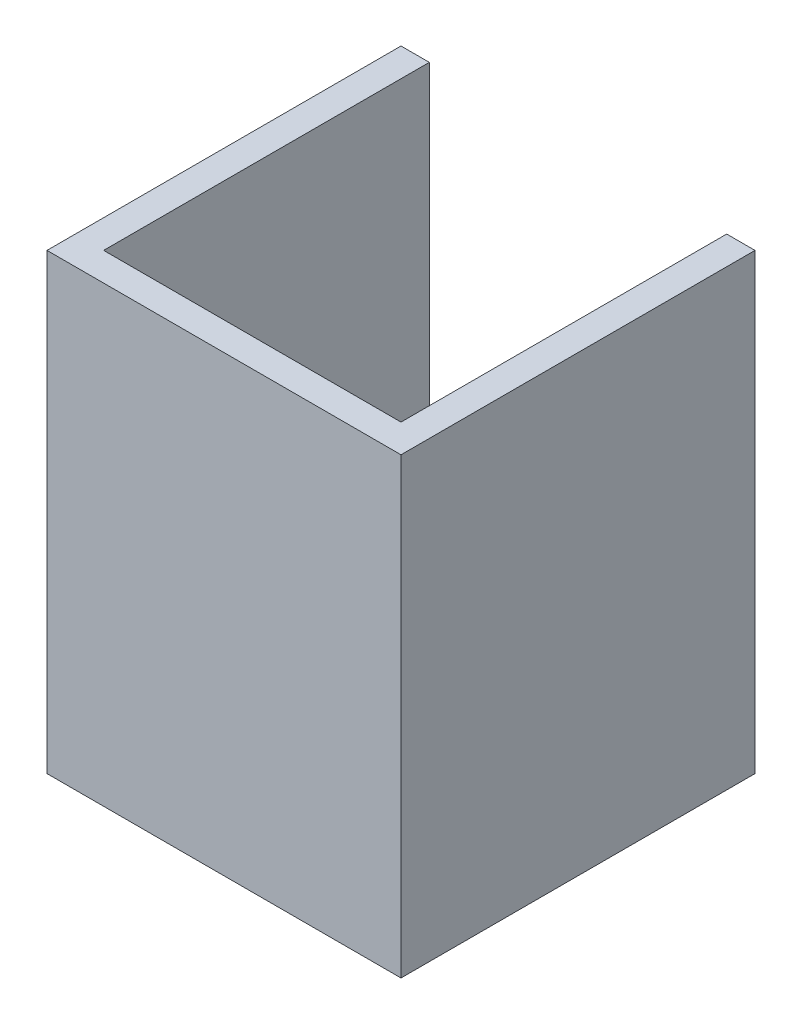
ISO-10303-21;
HEADER;
FILE_DESCRIPTION(('STEP AP214'),'2;1');
FILE_NAME('part.step','',(''),(''),'','','');
FILE_SCHEMA(('AUTOMOTIVE_DESIGN { 1 0 10303 214 1 1 1 1 }'));
ENDSEC;
DATA;
#1=APPLICATION_CONTEXT('core data for automotive mechanical design processes');
#2=APPLICATION_PROTOCOL_DEFINITION('international standard','automotive_design',2000,#1);
#3=PRODUCT_CONTEXT('',#1,'mechanical');
#4=PRODUCT('Part','Part','',(#3));
#5=PRODUCT_RELATED_PRODUCT_CATEGORY('part','',(#4));
#6=PRODUCT_DEFINITION_FORMATION('','',#4);
#7=PRODUCT_DEFINITION_CONTEXT('part definition',#1,'design');
#8=PRODUCT_DEFINITION('design','',#6,#7);
#9=PRODUCT_DEFINITION_SHAPE('','',#8);
#10=(LENGTH_UNIT() NAMED_UNIT(*) SI_UNIT(.MILLI.,.METRE.));
#11=(NAMED_UNIT(*) PLANE_ANGLE_UNIT() SI_UNIT($,.RADIAN.));
#12=(NAMED_UNIT(*) SI_UNIT($,.STERADIAN.) SOLID_ANGLE_UNIT());
#13=UNCERTAINTY_MEASURE_WITH_UNIT(LENGTH_MEASURE(1.E-05),#10,'distance_accuracy_value','');
#14=(GEOMETRIC_REPRESENTATION_CONTEXT(3) GLOBAL_UNCERTAINTY_ASSIGNED_CONTEXT((#13)) GLOBAL_UNIT_ASSIGNED_CONTEXT((#10,
#11,#12)) REPRESENTATION_CONTEXT('',''));
#15=CARTESIAN_POINT('',(0.,0.,0.));
#16=DIRECTION('',(0.,0.,1.));
#17=DIRECTION('',(1.,0.,0.));
#18=AXIS2_PLACEMENT_3D('',#15,#16,#17);
#19=CARTESIAN_POINT('',(0.,0.,0.));
#20=DIRECTION('',(0.,0.,-1.));
#21=DIRECTION('',(-1.,0.,0.));
#22=AXIS2_PLACEMENT_3D('',#19,#20,#21);
#23=PLANE('',#22);
#24=DIRECTION('',(0.,1.,0.));
#25=VECTOR('',#24,1.);
#26=CARTESIAN_POINT('',(7.5,0.,0.));
#27=LINE('',#26,#25);
#28=CARTESIAN_POINT('',(7.5,0.,0.));
#29=VERTEX_POINT('',#28);
#30=CARTESIAN_POINT('',(7.5,2.,0.));
#31=VERTEX_POINT('',#30);
#32=EDGE_CURVE('E169',#29,#31,#27,.T.);
#33=ORIENTED_EDGE('',*,*,#32,.F.);
#34=DIRECTION('',(1.,0.,0.));
#35=VECTOR('',#34,1.);
#36=CARTESIAN_POINT('',(0.,0.,0.));
#37=LINE('',#36,#35);
#38=CARTESIAN_POINT('',(0.,0.,0.));
#39=VERTEX_POINT('',#38);
#40=EDGE_CURVE('E158',#39,#29,#37,.T.);
#41=ORIENTED_EDGE('',*,*,#40,.F.);
#42=DIRECTION('',(0.,-1.,0.));
#43=VECTOR('',#42,1.);
#44=CARTESIAN_POINT('',(0.,0.,0.));
#45=LINE('',#44,#43);
#46=CARTESIAN_POINT('',(0.,32.,0.));
#47=VERTEX_POINT('',#46);
#48=EDGE_CURVE('E182',#47,#39,#45,.T.);
#49=ORIENTED_EDGE('',*,*,#48,.F.);
#50=DIRECTION('',(-1.,0.,0.));
#51=VECTOR('',#50,1.);
#52=CARTESIAN_POINT('',(0.,32.,0.));
#53=LINE('',#52,#51);
#54=CARTESIAN_POINT('',(2.,32.,0.));
#55=VERTEX_POINT('',#54);
#56=EDGE_CURVE('E243',#55,#47,#53,.T.);
#57=ORIENTED_EDGE('',*,*,#56,.F.);
#58=DIRECTION('',(0.,-1.,0.));
#59=VECTOR('',#58,1.);
#60=CARTESIAN_POINT('',(2.,0.,0.));
#61=LINE('',#60,#59);
#62=CARTESIAN_POINT('',(2.,2.,0.));
#63=VERTEX_POINT('',#62);
#64=EDGE_CURVE('E172',#55,#63,#61,.T.);
#65=ORIENTED_EDGE('',*,*,#64,.T.);
#66=DIRECTION('',(1.,0.,0.));
#67=VECTOR('',#66,1.);
#68=CARTESIAN_POINT('',(0.,2.,0.));
#69=LINE('',#68,#67);
#70=EDGE_CURVE('E215',#63,#31,#69,.T.);
#71=ORIENTED_EDGE('',*,*,#70,.T.);
#72=EDGE_LOOP('',(#33,#41,#49,#57,#65,#71));
#73=FACE_BOUND('',#72,.T.);
#74=ADVANCED_FACE('F45',(#73),#23,.T.);
#75=CARTESIAN_POINT('',(0.,2.,25.));
#76=DIRECTION('',(0.,1.,0.));
#77=DIRECTION('',(0.,0.,1.));
#78=AXIS2_PLACEMENT_3D('',#75,#76,#77);
#79=PLANE('',#78);
#80=DIRECTION('',(0.,0.,1.));
#81=VECTOR('',#80,1.);
#82=CARTESIAN_POINT('',(7.5,2.,0.));
#83=LINE('',#82,#81);
#84=CARTESIAN_POINT('',(7.5,2.,23.));
#85=VERTEX_POINT('',#84);
#86=EDGE_CURVE('E61',#31,#85,#83,.T.);
#87=ORIENTED_EDGE('',*,*,#86,.F.);
#88=ORIENTED_EDGE('',*,*,#70,.F.);
#89=DIRECTION('',(0.,0.,-1.));
#90=VECTOR('',#89,1.);
#91=CARTESIAN_POINT('',(2.,2.,25.));
#92=LINE('',#91,#90);
#93=CARTESIAN_POINT('',(2.,2.,23.));
#94=VERTEX_POINT('',#93);
#95=EDGE_CURVE('E178',#94,#63,#92,.T.);
#96=ORIENTED_EDGE('',*,*,#95,.F.);
#97=DIRECTION('',(1.,0.,0.));
#98=VECTOR('',#97,1.);
#99=CARTESIAN_POINT('',(0.,2.,23.));
#100=LINE('',#99,#98);
#101=EDGE_CURVE('E194',#94,#85,#100,.T.);
#102=ORIENTED_EDGE('',*,*,#101,.T.);
#103=EDGE_LOOP('',(#87,#88,#96,#102));
#104=FACE_BOUND('',#103,.T.);
#105=ADVANCED_FACE('F278',(#104),#79,.T.);
#106=DIRECTION('',(0.,1.,0.));
#107=VECTOR('',#106,1.);
#108=CARTESIAN_POINT('',(17.5,0.,0.));
#109=LINE('',#108,#107);
#110=CARTESIAN_POINT('',(17.5,0.,0.));
#111=VERTEX_POINT('',#110);
#112=CARTESIAN_POINT('',(17.5,2.,0.));
#113=VERTEX_POINT('',#112);
#114=EDGE_CURVE('E173',#111,#113,#109,.T.);
#115=ORIENTED_EDGE('',*,*,#114,.T.);
#116=CARTESIAN_POINT('',(23.,2.,0.));
#117=VERTEX_POINT('',#116);
#118=EDGE_CURVE('E69',#113,#117,#69,.T.);
#119=ORIENTED_EDGE('',*,*,#118,.T.);
#120=DIRECTION('',(0.,1.,0.));
#121=VECTOR('',#120,1.);
#122=CARTESIAN_POINT('',(23.,0.,0.));
#123=LINE('',#122,#121);
#124=CARTESIAN_POINT('',(23.,32.,0.));
#125=VERTEX_POINT('',#124);
#126=EDGE_CURVE('E189',#117,#125,#123,.T.);
#127=ORIENTED_EDGE('',*,*,#126,.T.);
#128=CARTESIAN_POINT('',(25.,32.,0.));
#129=VERTEX_POINT('',#128);
#130=EDGE_CURVE('E224',#129,#125,#53,.T.);
#131=ORIENTED_EDGE('',*,*,#130,.F.);
#132=DIRECTION('',(0.,1.,0.));
#133=VECTOR('',#132,1.);
#134=CARTESIAN_POINT('',(25.,0.,0.));
#135=LINE('',#134,#133);
#136=CARTESIAN_POINT('',(25.,0.,0.));
#137=VERTEX_POINT('',#136);
#138=EDGE_CURVE('E240',#137,#129,#135,.T.);
#139=ORIENTED_EDGE('',*,*,#138,.F.);
#140=EDGE_CURVE('E237',#111,#137,#37,.T.);
#141=ORIENTED_EDGE('',*,*,#140,.F.);
#142=EDGE_LOOP('',(#115,#119,#127,#131,#139,#141));
#143=FACE_BOUND('',#142,.T.);
#144=ADVANCED_FACE('F263',(#143),#23,.T.);
#145=CARTESIAN_POINT('',(0.,0.,25.));
#146=DIRECTION('',(1.,0.,0.));
#147=DIRECTION('',(0.,0.,-1.));
#148=AXIS2_PLACEMENT_3D('',#145,#146,#147);
#149=PLANE('',#148);
#150=ORIENTED_EDGE('',*,*,#48,.T.);
#151=DIRECTION('',(0.,0.,-1.));
#152=VECTOR('',#151,1.);
#153=CARTESIAN_POINT('',(0.,0.,25.));
#154=LINE('',#153,#152);
#155=CARTESIAN_POINT('',(0.,0.,25.));
#156=VERTEX_POINT('',#155);
#157=EDGE_CURVE('E11',#156,#39,#154,.T.);
#158=ORIENTED_EDGE('',*,*,#157,.F.);
#159=DIRECTION('',(0.,-1.,0.));
#160=VECTOR('',#159,1.);
#161=CARTESIAN_POINT('',(0.,0.,25.));
#162=LINE('',#161,#160);
#163=CARTESIAN_POINT('',(0.,32.,25.));
#164=VERTEX_POINT('',#163);
#165=EDGE_CURVE('E219',#164,#156,#162,.T.);
#166=ORIENTED_EDGE('',*,*,#165,.F.);
#167=DIRECTION('',(0.,0.,-1.));
#168=VECTOR('',#167,1.);
#169=CARTESIAN_POINT('',(0.,32.,25.));
#170=LINE('',#169,#168);
#171=EDGE_CURVE('E233',#164,#47,#170,.T.);
#172=ORIENTED_EDGE('',*,*,#171,.T.);
#173=EDGE_LOOP('',(#150,#158,#166,#172));
#174=FACE_BOUND('',#173,.T.);
#175=ADVANCED_FACE('F47',(#174),#149,.F.);
#176=CARTESIAN_POINT('',(0.,0.,25.));
#177=DIRECTION('',(0.,1.,0.));
#178=DIRECTION('',(0.,0.,1.));
#179=AXIS2_PLACEMENT_3D('',#176,#177,#178);
#180=PLANE('',#179);
#181=ORIENTED_EDGE('',*,*,#40,.T.);
#182=DIRECTION('',(0.,0.,1.));
#183=VECTOR('',#182,1.);
#184=CARTESIAN_POINT('',(7.5,0.,0.));
#185=LINE('',#184,#183);
#186=CARTESIAN_POINT('',(7.5,0.,23.));
#187=VERTEX_POINT('',#186);
#188=EDGE_CURVE('E138',#29,#187,#185,.T.);
#189=ORIENTED_EDGE('',*,*,#188,.T.);
#190=DIRECTION('',(1.,0.,0.));
#191=VECTOR('',#190,1.);
#192=CARTESIAN_POINT('',(7.5,0.,23.));
#193=LINE('',#192,#191);
#194=CARTESIAN_POINT('',(17.5,0.,23.));
#195=VERTEX_POINT('',#194);
#196=EDGE_CURVE('E147',#187,#195,#193,.T.);
#197=ORIENTED_EDGE('',*,*,#196,.T.);
#198=DIRECTION('',(0.,0.,-1.));
#199=VECTOR('',#198,1.);
#200=CARTESIAN_POINT('',(17.5,0.,0.));
#201=LINE('',#200,#199);
#202=EDGE_CURVE('E144',#195,#111,#201,.T.);
#203=ORIENTED_EDGE('',*,*,#202,.T.);
#204=ORIENTED_EDGE('',*,*,#140,.T.);
#205=DIRECTION('',(0.,0.,-1.));
#206=VECTOR('',#205,1.);
#207=CARTESIAN_POINT('',(25.,0.,25.));
#208=LINE('',#207,#206);
#209=CARTESIAN_POINT('',(25.,0.,25.));
#210=VERTEX_POINT('',#209);
#211=EDGE_CURVE('E54',#210,#137,#208,.T.);
#212=ORIENTED_EDGE('',*,*,#211,.F.);
#213=DIRECTION('',(1.,0.,0.));
#214=VECTOR('',#213,1.);
#215=CARTESIAN_POINT('',(0.,0.,25.));
#216=LINE('',#215,#214);
#217=EDGE_CURVE('E223',#156,#210,#216,.T.);
#218=ORIENTED_EDGE('',*,*,#217,.F.);
#219=ORIENTED_EDGE('',*,*,#157,.T.);
#220=EDGE_LOOP('',(#181,#189,#197,#203,#204,#212,#218,#219));
#221=FACE_BOUND('',#220,.T.);
#222=ADVANCED_FACE('F157',(#221),#180,.F.);
#223=CARTESIAN_POINT('',(25.,0.,25.));
#224=DIRECTION('',(-1.,0.,0.));
#225=DIRECTION('',(0.,0.,1.));
#226=AXIS2_PLACEMENT_3D('',#223,#224,#225);
#227=PLANE('',#226);
#228=ORIENTED_EDGE('',*,*,#138,.T.);
#229=DIRECTION('',(0.,0.,-1.));
#230=VECTOR('',#229,1.);
#231=CARTESIAN_POINT('',(25.,32.,25.));
#232=LINE('',#231,#230);
#233=CARTESIAN_POINT('',(25.,32.,25.));
#234=VERTEX_POINT('',#233);
#235=EDGE_CURVE('E250',#234,#129,#232,.T.);
#236=ORIENTED_EDGE('',*,*,#235,.F.);
#237=DIRECTION('',(0.,1.,0.));
#238=VECTOR('',#237,1.);
#239=CARTESIAN_POINT('',(25.,0.,25.));
#240=LINE('',#239,#238);
#241=EDGE_CURVE('E227',#210,#234,#240,.T.);
#242=ORIENTED_EDGE('',*,*,#241,.F.);
#243=ORIENTED_EDGE('',*,*,#211,.T.);
#244=EDGE_LOOP('',(#228,#236,#242,#243));
#245=FACE_BOUND('',#244,.T.);
#246=ADVANCED_FACE('F259',(#245),#227,.F.);
#247=CARTESIAN_POINT('',(0.,32.,25.));
#248=DIRECTION('',(0.,-1.,0.));
#249=DIRECTION('',(0.,0.,-1.));
#250=AXIS2_PLACEMENT_3D('',#247,#248,#249);
#251=PLANE('',#250);
#252=DIRECTION('',(-1.,0.,0.));
#253=VECTOR('',#252,1.);
#254=CARTESIAN_POINT('',(0.,32.,23.));
#255=LINE('',#254,#253);
#256=CARTESIAN_POINT('',(23.,32.,23.));
#257=VERTEX_POINT('',#256);
#258=CARTESIAN_POINT('',(2.,32.,23.));
#259=VERTEX_POINT('',#258);
#260=EDGE_CURVE('E200',#257,#259,#255,.T.);
#261=ORIENTED_EDGE('',*,*,#260,.T.);
#262=DIRECTION('',(0.,0.,-1.));
#263=VECTOR('',#262,1.);
#264=CARTESIAN_POINT('',(2.,32.,25.));
#265=LINE('',#264,#263);
#266=EDGE_CURVE('E204',#259,#55,#265,.T.);
#267=ORIENTED_EDGE('',*,*,#266,.T.);
#268=ORIENTED_EDGE('',*,*,#56,.T.);
#269=ORIENTED_EDGE('',*,*,#171,.F.);
#270=DIRECTION('',(-1.,0.,0.));
#271=VECTOR('',#270,1.);
#272=CARTESIAN_POINT('',(0.,32.,25.));
#273=LINE('',#272,#271);
#274=EDGE_CURVE('E230',#234,#164,#273,.T.);
#275=ORIENTED_EDGE('',*,*,#274,.F.);
#276=ORIENTED_EDGE('',*,*,#235,.T.);
#277=ORIENTED_EDGE('',*,*,#130,.T.);
#278=DIRECTION('',(0.,0.,-1.));
#279=VECTOR('',#278,1.);
#280=CARTESIAN_POINT('',(23.,32.,25.));
#281=LINE('',#280,#279);
#282=EDGE_CURVE('E193',#257,#125,#281,.T.);
#283=ORIENTED_EDGE('',*,*,#282,.F.);
#284=EDGE_LOOP('',(#261,#267,#268,#269,#275,#276,#277,#283));
#285=FACE_BOUND('',#284,.T.);
#286=ADVANCED_FACE('F266',(#285),#251,.F.);
#287=CARTESIAN_POINT('',(0.,0.,25.));
#288=DIRECTION('',(0.,0.,-1.));
#289=DIRECTION('',(-1.,0.,0.));
#290=AXIS2_PLACEMENT_3D('',#287,#288,#289);
#291=PLANE('',#290);
#292=ORIENTED_EDGE('',*,*,#165,.T.);
#293=ORIENTED_EDGE('',*,*,#217,.T.);
#294=ORIENTED_EDGE('',*,*,#241,.T.);
#295=ORIENTED_EDGE('',*,*,#274,.T.);
#296=EDGE_LOOP('',(#292,#293,#294,#295));
#297=FACE_BOUND('',#296,.T.);
#298=ADVANCED_FACE('F271',(#297),#291,.F.);
#299=CARTESIAN_POINT('',(2.,0.,25.));
#300=DIRECTION('',(1.,0.,0.));
#301=DIRECTION('',(0.,0.,-1.));
#302=AXIS2_PLACEMENT_3D('',#299,#300,#301);
#303=PLANE('',#302);
#304=ORIENTED_EDGE('',*,*,#64,.F.);
#305=ORIENTED_EDGE('',*,*,#266,.F.);
#306=DIRECTION('',(0.,-1.,0.));
#307=VECTOR('',#306,1.);
#308=CARTESIAN_POINT('',(2.,0.,23.));
#309=LINE('',#308,#307);
#310=EDGE_CURVE('E184',#259,#94,#309,.T.);
#311=ORIENTED_EDGE('',*,*,#310,.T.);
#312=ORIENTED_EDGE('',*,*,#95,.T.);
#313=EDGE_LOOP('',(#304,#305,#311,#312));
#314=FACE_BOUND('',#313,.T.);
#315=ADVANCED_FACE('F282',(#314),#303,.T.);
#316=DIRECTION('',(0.,0.,-1.));
#317=VECTOR('',#316,1.);
#318=CARTESIAN_POINT('',(17.5,2.,0.));
#319=LINE('',#318,#317);
#320=CARTESIAN_POINT('',(17.5,2.,23.));
#321=VERTEX_POINT('',#320);
#322=EDGE_CURVE('E160',#321,#113,#319,.T.);
#323=ORIENTED_EDGE('',*,*,#322,.F.);
#324=CARTESIAN_POINT('',(23.,2.,23.));
#325=VERTEX_POINT('',#324);
#326=EDGE_CURVE('E188',#321,#325,#100,.T.);
#327=ORIENTED_EDGE('',*,*,#326,.T.);
#328=DIRECTION('',(0.,0.,-1.));
#329=VECTOR('',#328,1.);
#330=CARTESIAN_POINT('',(23.,2.,25.));
#331=LINE('',#330,#329);
#332=EDGE_CURVE('E183',#325,#117,#331,.T.);
#333=ORIENTED_EDGE('',*,*,#332,.T.);
#334=ORIENTED_EDGE('',*,*,#118,.F.);
#335=EDGE_LOOP('',(#323,#327,#333,#334));
#336=FACE_BOUND('',#335,.T.);
#337=ADVANCED_FACE('F289',(#336),#79,.T.);
#338=CARTESIAN_POINT('',(23.,0.,25.));
#339=DIRECTION('',(-1.,0.,0.));
#340=DIRECTION('',(0.,0.,1.));
#341=AXIS2_PLACEMENT_3D('',#338,#339,#340);
#342=PLANE('',#341);
#343=ORIENTED_EDGE('',*,*,#126,.F.);
#344=ORIENTED_EDGE('',*,*,#332,.F.);
#345=DIRECTION('',(0.,1.,0.));
#346=VECTOR('',#345,1.);
#347=CARTESIAN_POINT('',(23.,0.,23.));
#348=LINE('',#347,#346);
#349=EDGE_CURVE('E197',#325,#257,#348,.T.);
#350=ORIENTED_EDGE('',*,*,#349,.T.);
#351=ORIENTED_EDGE('',*,*,#282,.T.);
#352=EDGE_LOOP('',(#343,#344,#350,#351));
#353=FACE_BOUND('',#352,.T.);
#354=ADVANCED_FACE('F286',(#353),#342,.T.);
#355=CARTESIAN_POINT('',(0.,0.,23.));
#356=DIRECTION('',(0.,0.,-1.));
#357=DIRECTION('',(-1.,0.,0.));
#358=AXIS2_PLACEMENT_3D('',#355,#356,#357);
#359=PLANE('',#358);
#360=ORIENTED_EDGE('',*,*,#310,.F.);
#361=ORIENTED_EDGE('',*,*,#260,.F.);
#362=ORIENTED_EDGE('',*,*,#349,.F.);
#363=ORIENTED_EDGE('',*,*,#326,.F.);
#364=DIRECTION('',(0.,1.,0.));
#365=VECTOR('',#364,1.);
#366=CARTESIAN_POINT('',(17.5,0.,23.));
#367=LINE('',#366,#365);
#368=EDGE_CURVE('E143',#195,#321,#367,.T.);
#369=ORIENTED_EDGE('',*,*,#368,.F.);
#370=ORIENTED_EDGE('',*,*,#196,.F.);
#371=DIRECTION('',(0.,1.,0.));
#372=VECTOR('',#371,1.);
#373=CARTESIAN_POINT('',(7.5,0.,23.));
#374=LINE('',#373,#372);
#375=EDGE_CURVE('E134',#187,#85,#374,.T.);
#376=ORIENTED_EDGE('',*,*,#375,.T.);
#377=ORIENTED_EDGE('',*,*,#101,.F.);
#378=EDGE_LOOP('',(#360,#361,#362,#363,#369,#370,#376,#377));
#379=FACE_BOUND('',#378,.T.);
#380=ADVANCED_FACE('F149',(#379),#359,.T.);
#381=CARTESIAN_POINT('',(7.5,0.,0.));
#382=DIRECTION('',(-1.,0.,0.));
#383=DIRECTION('',(0.,0.,1.));
#384=AXIS2_PLACEMENT_3D('',#381,#382,#383);
#385=PLANE('',#384);
#386=ORIENTED_EDGE('',*,*,#86,.T.);
#387=ORIENTED_EDGE('',*,*,#375,.F.);
#388=ORIENTED_EDGE('',*,*,#188,.F.);
#389=ORIENTED_EDGE('',*,*,#32,.T.);
#390=EDGE_LOOP('',(#386,#387,#388,#389));
#391=FACE_BOUND('',#390,.T.);
#392=ADVANCED_FACE('F136',(#391),#385,.F.);
#393=CARTESIAN_POINT('',(17.5,0.,0.));
#394=DIRECTION('',(1.,0.,0.));
#395=DIRECTION('',(0.,0.,-1.));
#396=AXIS2_PLACEMENT_3D('',#393,#394,#395);
#397=PLANE('',#396);
#398=ORIENTED_EDGE('',*,*,#322,.T.);
#399=ORIENTED_EDGE('',*,*,#114,.F.);
#400=ORIENTED_EDGE('',*,*,#202,.F.);
#401=ORIENTED_EDGE('',*,*,#368,.T.);
#402=EDGE_LOOP('',(#398,#399,#400,#401));
#403=FACE_BOUND('',#402,.T.);
#404=ADVANCED_FACE('F295',(#403),#397,.F.);
#405=CLOSED_SHELL('',(#74,#105,#144,#175,#222,#246,#286,#298,#315,#337,#354,#380,#392,#404));
#406=MANIFOLD_SOLID_BREP('B2',#405);
#407=ADVANCED_BREP_SHAPE_REPRESENTATION('',(#18,#406),#14);
#408=SHAPE_DEFINITION_REPRESENTATION(#9,#407);
ENDSEC;
END-ISO-10303-21;
